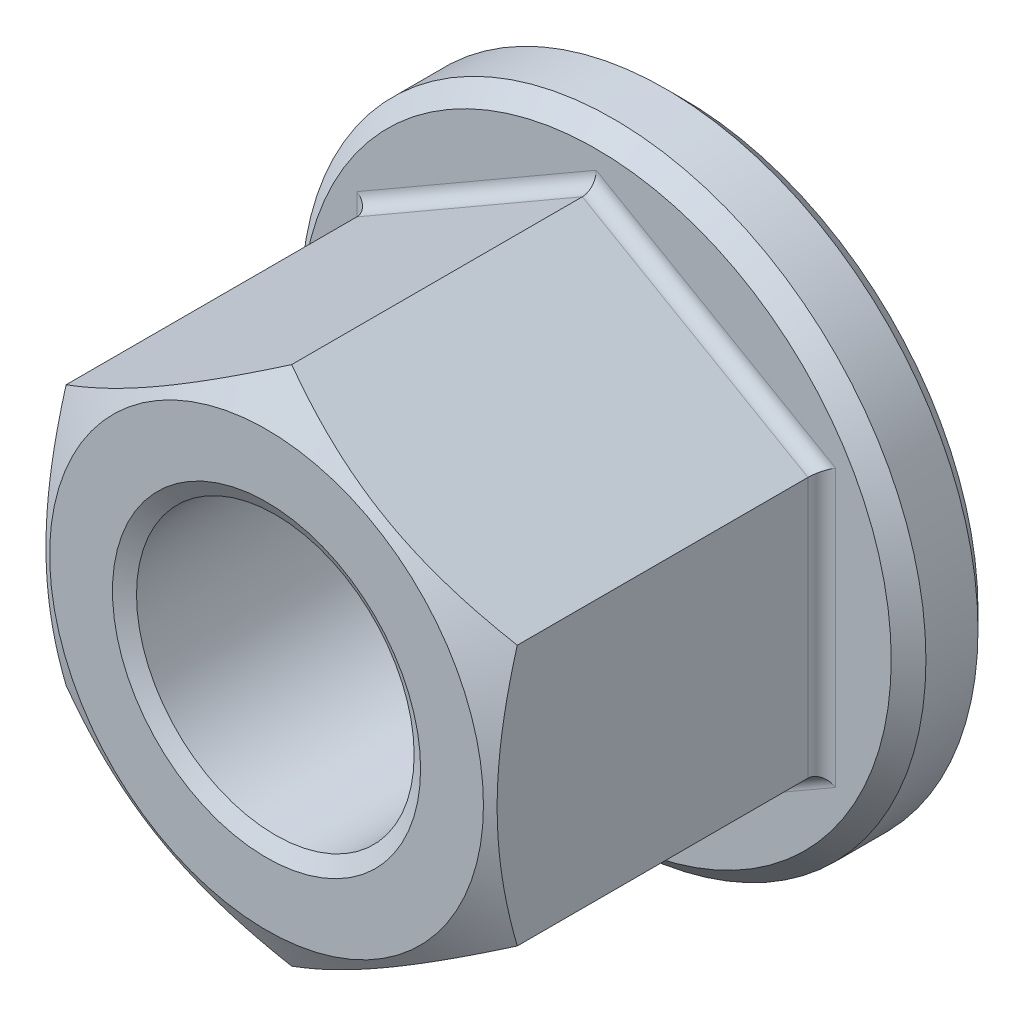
ISO-10303-21;
HEADER;
FILE_DESCRIPTION(('STEP AP214'),'2;1');
FILE_NAME('part.step','',(''),(''),'','','');
FILE_SCHEMA(('AUTOMOTIVE_DESIGN { 1 0 10303 214 1 1 1 1 }'));
ENDSEC;
DATA;
#1=APPLICATION_CONTEXT('core data for automotive mechanical design processes');
#2=APPLICATION_PROTOCOL_DEFINITION('international standard','automotive_design',2000,#1);
#3=PRODUCT_CONTEXT('',#1,'mechanical');
#4=PRODUCT('Part','Part','',(#3));
#5=PRODUCT_RELATED_PRODUCT_CATEGORY('part','',(#4));
#6=PRODUCT_DEFINITION_FORMATION('','',#4);
#7=PRODUCT_DEFINITION_CONTEXT('part definition',#1,'design');
#8=PRODUCT_DEFINITION('design','',#6,#7);
#9=PRODUCT_DEFINITION_SHAPE('','',#8);
#10=(LENGTH_UNIT() NAMED_UNIT(*) SI_UNIT(.MILLI.,.METRE.));
#11=(NAMED_UNIT(*) PLANE_ANGLE_UNIT() SI_UNIT($,.RADIAN.));
#12=(NAMED_UNIT(*) SI_UNIT($,.STERADIAN.) SOLID_ANGLE_UNIT());
#13=UNCERTAINTY_MEASURE_WITH_UNIT(LENGTH_MEASURE(1.E-05),#10,'distance_accuracy_value','');
#14=(GEOMETRIC_REPRESENTATION_CONTEXT(3) GLOBAL_UNCERTAINTY_ASSIGNED_CONTEXT((#13)) GLOBAL_UNIT_ASSIGNED_CONTEXT((#10,
#11,#12)) REPRESENTATION_CONTEXT('',''));
#15=CARTESIAN_POINT('',(0.,0.,0.));
#16=DIRECTION('',(0.,0.,1.));
#17=DIRECTION('',(1.,0.,0.));
#18=AXIS2_PLACEMENT_3D('',#15,#16,#17);
#19=CARTESIAN_POINT('',(-6.5,-3.75277674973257,2.5));
#20=DIRECTION('',(-0.5,-0.866025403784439,0.));
#21=DIRECTION('',(0.866025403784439,-0.5,0.));
#22=AXIS2_PLACEMENT_3D('',#19,#20,#21);
#23=PLANE('',#22);
#24=DIRECTION('',(0.,0.,1.));
#25=VECTOR('',#24,1.);
#26=CARTESIAN_POINT('',(-6.5,-3.75277674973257,2.5));
#27=LINE('',#26,#25);
#28=CARTESIAN_POINT('',(-6.5,-3.75277674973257,2.9));
#29=VERTEX_POINT('',#28);
#30=CARTESIAN_POINT('',(-6.5,-3.75277674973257,11.2751058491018));
#31=VERTEX_POINT('',#30);
#32=EDGE_CURVE('E166',#29,#31,#27,.T.);
#33=ORIENTED_EDGE('',*,*,#32,.F.);
#34=DIRECTION('',(0.866025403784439,-0.5,0.));
#35=VECTOR('',#34,1.);
#36=CARTESIAN_POINT('',(0.,-7.50555349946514,2.9));
#37=LINE('',#36,#35);
#38=CARTESIAN_POINT('',(0.,-7.50555349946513,2.9));
#39=VERTEX_POINT('',#38);
#40=EDGE_CURVE('E37',#29,#39,#37,.T.);
#41=ORIENTED_EDGE('',*,*,#40,.T.);
#42=DIRECTION('',(0.,0.,1.));
#43=VECTOR('',#42,1.);
#44=CARTESIAN_POINT('',(0.,-7.50555349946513,2.5));
#45=LINE('',#44,#43);
#46=CARTESIAN_POINT('',(0.,-7.50555349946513,11.2751058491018));
#47=VERTEX_POINT('',#46);
#48=EDGE_CURVE('E97',#39,#47,#45,.T.);
#49=ORIENTED_EDGE('',*,*,#48,.T.);
#50=CARTESIAN_POINT('',(0.0002,-7.50566896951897,11.2750391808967));
#51=CARTESIAN_POINT('',(-0.142677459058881,-7.4231786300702,11.3226580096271));
#52=CARTESIAN_POINT('',(-0.286087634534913,-7.34038072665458,11.3681157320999));
#53=CARTESIAN_POINT('',(-0.574072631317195,-7.17411251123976,11.4541137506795));
#54=CARTESIAN_POINT('',(-0.718647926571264,-7.09064192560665,11.4946519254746));
#55=CARTESIAN_POINT('',(-1.15468865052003,-6.83889369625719,11.6080914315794));
#56=CARTESIAN_POINT('',(-1.44787528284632,-6.66962231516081,11.6726146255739));
#57=CARTESIAN_POINT('',(-1.88662374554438,-6.41631077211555,11.7482758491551));
#58=CARTESIAN_POINT('',(-2.03087463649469,-6.33302748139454,11.7698295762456));
#59=CARTESIAN_POINT('',(-2.32002821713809,-6.16608458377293,11.8059721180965));
#60=CARTESIAN_POINT('',(-2.46493084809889,-6.08242501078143,11.8205615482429));
#61=CARTESIAN_POINT('',(-2.75498777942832,-5.91496056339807,11.8424036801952));
#62=CARTESIAN_POINT('',(-2.90014160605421,-5.8311559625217,11.8496647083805));
#63=CARTESIAN_POINT('',(-3.19057533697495,-5.66347396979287,11.8567021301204));
#64=CARTESIAN_POINT('',(-3.33585523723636,-5.5795965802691,11.8564787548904));
#65=CARTESIAN_POINT('',(-3.73387594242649,-5.34979921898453,11.8455789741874));
#66=CARTESIAN_POINT('',(-3.98648646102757,-5.20395446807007,11.8272806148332));
#67=CARTESIAN_POINT('',(-4.49002967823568,-4.91323365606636,11.7692560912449));
#68=CARTESIAN_POINT('',(-4.74096060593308,-4.76835861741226,11.7295100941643));
#69=CARTESIAN_POINT('',(-5.24551722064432,-4.47705272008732,11.6301565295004));
#70=CARTESIAN_POINT('',(-5.49907924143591,-4.33065861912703,11.5701280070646));
#71=CARTESIAN_POINT('',(-6.00242193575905,-4.04005357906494,11.4338874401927));
#72=CARTESIAN_POINT('',(-6.25220905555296,-3.89583891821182,11.357707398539));
#73=CARTESIAN_POINT('',(-6.5002,-3.75266127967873,11.2750391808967));
#74=B_SPLINE_CURVE_WITH_KNOTS('',3,(#50,#51,#52,#53,#54,#55,#56,#57,#58,#59,#60,#61,#62,#63,#64,
#65,#66,#67,#68,#69,#70,#71,#72,#73),.UNSPECIFIED.,.F.,.F.,(4,2,2,2,2,2,2,2,2,2,2,4),(0.,
0.515105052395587,1.03043143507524,2.06322554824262,2.56697389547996,3.07067772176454,
3.57380860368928,4.0769239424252,4.9527935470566,5.82947446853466,6.72559912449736,
7.61996451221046),.UNSPECIFIED.);
#75=EDGE_CURVE('E109',#47,#31,#74,.T.);
#76=ORIENTED_EDGE('',*,*,#75,.T.);
#77=EDGE_LOOP('',(#33,#41,#49,#76));
#78=FACE_BOUND('',#77,.T.);
#79=ADVANCED_FACE('F14',(#78),#23,.T.);
#80=CARTESIAN_POINT('',(-6.5,3.75277674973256,2.5));
#81=DIRECTION('',(-1.,0.,0.));
#82=DIRECTION('',(0.,-1.,0.));
#83=AXIS2_PLACEMENT_3D('',#80,#81,#82);
#84=PLANE('',#83);
#85=DIRECTION('',(0.,0.,1.));
#86=VECTOR('',#85,1.);
#87=CARTESIAN_POINT('',(-6.5,3.75277674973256,2.5));
#88=LINE('',#87,#86);
#89=CARTESIAN_POINT('',(-6.5,3.75277674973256,2.9));
#90=VERTEX_POINT('',#89);
#91=CARTESIAN_POINT('',(-6.5,3.75277674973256,11.2751058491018));
#92=VERTEX_POINT('',#91);
#93=EDGE_CURVE('E169',#90,#92,#88,.T.);
#94=ORIENTED_EDGE('',*,*,#93,.F.);
#95=DIRECTION('',(0.,-1.,0.));
#96=VECTOR('',#95,1.);
#97=CARTESIAN_POINT('',(-6.5,-3.75277674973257,2.9));
#98=LINE('',#97,#96);
#99=EDGE_CURVE('E30',#90,#29,#98,.T.);
#100=ORIENTED_EDGE('',*,*,#99,.T.);
#101=ORIENTED_EDGE('',*,*,#32,.T.);
#102=CARTESIAN_POINT('',(-6.5,-10.0756014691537,8.68582539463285));
#103=CARTESIAN_POINT('',(-6.5,-9.79164665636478,8.8235495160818));
#104=CARTESIAN_POINT('',(-6.5,-9.50703927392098,8.95995128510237));
#105=CARTESIAN_POINT('',(-6.5,-8.93617212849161,9.22936595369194));
#106=CARTESIAN_POINT('',(-6.5,-8.64991211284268,9.36237831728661));
#107=CARTESIAN_POINT('',(-6.5,-8.07391640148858,9.62493968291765));
#108=CARTESIAN_POINT('',(-6.5,-7.78417026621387,9.75446586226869));
#109=CARTESIAN_POINT('',(-6.5,-7.20237057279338,10.0082079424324));
#110=CARTESIAN_POINT('',(-6.5,-6.91031712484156,10.1324240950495));
#111=CARTESIAN_POINT('',(-6.5,-6.31423312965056,10.3779346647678));
#112=CARTESIAN_POINT('',(-6.5,-6.01011411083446,10.4990154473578));
#113=CARTESIAN_POINT('',(-6.5,-5.39831666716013,10.7320013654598));
#114=CARTESIAN_POINT('',(-6.5,-5.09063784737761,10.8439054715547));
#115=CARTESIAN_POINT('',(-6.5,-4.47180892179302,11.0555986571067));
#116=CARTESIAN_POINT('',(-6.5,-4.16066728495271,11.1554122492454));
#117=CARTESIAN_POINT('',(-6.5,-3.53391889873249,11.3397182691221));
#118=CARTESIAN_POINT('',(-6.5,-3.21831358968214,11.4242155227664));
#119=CARTESIAN_POINT('',(-6.5,-2.58412103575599,11.5734121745));
#120=CARTESIAN_POINT('',(-6.5,-2.2655579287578,11.6382125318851));
#121=CARTESIAN_POINT('',(-6.5,-1.62443244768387,11.7442965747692));
#122=CARTESIAN_POINT('',(-6.5,-1.30187048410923,11.7855826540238));
#123=CARTESIAN_POINT('',(-6.5,-0.818454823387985,11.8271350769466));
#124=CARTESIAN_POINT('',(-6.5,-0.658436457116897,11.8375863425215));
#125=CARTESIAN_POINT('',(-6.5,-0.33809408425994,11.8517188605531));
#126=CARTESIAN_POINT('',(-6.5,-0.177770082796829,11.8554002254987));
#127=CARTESIAN_POINT('',(-6.5,0.142891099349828,11.8558976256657));
#128=CARTESIAN_POINT('',(-6.5,0.303228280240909,11.8527135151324));
#129=CARTESIAN_POINT('',(-6.5,0.623626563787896,11.8395594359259));
#130=CARTESIAN_POINT('',(-6.5,0.783687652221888,11.8295891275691));
#131=CARTESIAN_POINT('',(-6.5,1.16834782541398,11.7976839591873));
#132=CARTESIAN_POINT('',(-6.5,1.39268547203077,11.7725302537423));
#133=CARTESIAN_POINT('',(-6.5,1.83968347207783,11.7102631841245));
#134=CARTESIAN_POINT('',(-6.5,2.0623435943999,11.6731482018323));
#135=CARTESIAN_POINT('',(-6.5,2.72754525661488,11.5458308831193));
#136=CARTESIAN_POINT('',(-6.5,3.16707359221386,11.4396781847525));
#137=CARTESIAN_POINT('',(-6.5,3.82460329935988,11.2556759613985));
#138=CARTESIAN_POINT('',(-6.5,4.04601181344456,11.1893039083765));
#139=CARTESIAN_POINT('',(-6.5,4.48667640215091,11.0496985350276));
#140=CARTESIAN_POINT('',(-6.5,4.70593246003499,10.9764651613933));
#141=CARTESIAN_POINT('',(-6.5,5.14236696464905,10.8243099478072));
#142=CARTESIAN_POINT('',(-6.5,5.359546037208,10.745389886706));
#143=CARTESIAN_POINT('',(-6.5,5.79210189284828,10.582786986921));
#144=CARTESIAN_POINT('',(-6.5,6.00747872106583,10.4991042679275));
#145=CARTESIAN_POINT('',(-6.5,6.60786614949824,10.2594217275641));
#146=CARTESIAN_POINT('',(-6.5,6.99110859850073,10.0989963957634));
#147=CARTESIAN_POINT('',(-6.5,7.75355950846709,9.76879628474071));
#148=CARTESIAN_POINT('',(-6.5,8.13276748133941,9.59902038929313));
#149=CARTESIAN_POINT('',(-6.5,8.88813120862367,9.25243586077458));
#150=CARTESIAN_POINT('',(-6.5,9.26428566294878,9.07562440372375));
#151=CARTESIAN_POINT('',(-6.5,10.0140399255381,8.71672619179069));
#152=CARTESIAN_POINT('',(-6.5,10.3876398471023,8.53463967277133));
#153=CARTESIAN_POINT('',(-6.5,11.1334315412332,8.16608087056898));
#154=CARTESIAN_POINT('',(-6.5,11.5056199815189,7.97960185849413));
#155=CARTESIAN_POINT('',(-6.5,12.248368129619,7.60342486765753));
#156=CARTESIAN_POINT('',(-6.5,12.6189278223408,7.41372685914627));
#157=CARTESIAN_POINT('',(-6.5,13.3586342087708,7.03180958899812));
#158=CARTESIAN_POINT('',(-6.5,13.7277812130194,6.83959092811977));
#159=CARTESIAN_POINT('',(-6.5,14.4649861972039,6.45307537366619));
#160=CARTESIAN_POINT('',(-6.5,14.8330441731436,6.25877847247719));
#161=CARTESIAN_POINT('',(-6.5,15.8541555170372,5.71672660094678));
#162=CARTESIAN_POINT('',(-6.5,16.5062381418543,5.36714339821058));
#163=CARTESIAN_POINT('',(-6.5,17.8083666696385,4.66411009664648));
#164=CARTESIAN_POINT('',(-6.5,18.4584124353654,4.31065974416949));
#165=CARTESIAN_POINT('',(-6.5,19.7547720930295,3.60208828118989));
#166=CARTESIAN_POINT('',(-6.5,20.4010911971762,3.24697669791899));
#167=CARTESIAN_POINT('',(-6.5,21.6924610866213,2.53457751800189));
#168=CARTESIAN_POINT('',(-6.5,22.3375119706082,2.17729010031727));
#169=CARTESIAN_POINT('',(-6.5,22.9821231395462,1.81921653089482));
#170=B_SPLINE_CURVE_WITH_KNOTS('',3,(#102,#103,#104,#105,#106,#107,#108,#109,#110,#111,#112,
#113,#114,#115,#116,#117,#118,#119,#120,#121,#122,#123,#124,#125,#126,#127,#128,#129,#130,#131,
#132,#133,#134,#135,#136,#137,#138,#139,#140,#141,#142,#143,#144,#145,#146,#147,#148,#149,#150,
#151,#152,#153,#154,#155,#156,#157,#158,#159,#160,#161,#162,#163,#164,#165,#166,#167,#168,#169),
.UNSPECIFIED.,.F.,.F.,(4,2,2,2,2,2,2,2,2,2,2,2,2,2,2,2,2,2,2,2,2,2,2,2,2,2,2,2,2,2,2,2,2,4),(0.,
0.94678741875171,1.89372363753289,2.84581999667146,3.79787115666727,4.7797651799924,
5.76176919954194,6.74174771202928,7.72141691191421,8.69597654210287,9.67043694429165,
10.1513934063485,10.632341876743,11.1133005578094,11.5942833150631,12.2711316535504,
12.9480715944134,14.3026549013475,14.9960254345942,15.6894013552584,16.3825613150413,
17.0757038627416,18.321906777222,19.5682587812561,20.8151162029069,22.0619179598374,
23.3107730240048,24.5596396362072,25.8082138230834,27.0567925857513,29.2764076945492,
31.4961692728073,33.7085146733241,35.9206805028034),.UNSPECIFIED.);
#171=EDGE_CURVE('E161',#31,#92,#170,.T.);
#172=ORIENTED_EDGE('',*,*,#171,.T.);
#173=EDGE_LOOP('',(#94,#100,#101,#172));
#174=FACE_BOUND('',#173,.T.);
#175=ADVANCED_FACE('F151',(#174),#84,.T.);
#176=CARTESIAN_POINT('',(0.,7.50555349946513,2.5));
#177=DIRECTION('',(-0.5,0.866025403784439,0.));
#178=DIRECTION('',(-0.866025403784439,-0.5,0.));
#179=AXIS2_PLACEMENT_3D('',#176,#177,#178);
#180=PLANE('',#179);
#181=DIRECTION('',(0.,0.,1.));
#182=VECTOR('',#181,1.);
#183=CARTESIAN_POINT('',(0.,7.50555349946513,2.5));
#184=LINE('',#183,#182);
#185=CARTESIAN_POINT('',(0.,7.50555349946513,2.9));
#186=VERTEX_POINT('',#185);
#187=CARTESIAN_POINT('',(0.,7.50555349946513,11.2751058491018));
#188=VERTEX_POINT('',#187);
#189=EDGE_CURVE('E171',#186,#188,#184,.T.);
#190=ORIENTED_EDGE('',*,*,#189,.F.);
#191=DIRECTION('',(-0.866025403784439,-0.5,0.));
#192=VECTOR('',#191,1.);
#193=CARTESIAN_POINT('',(-6.5,3.75277674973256,2.9));
#194=LINE('',#193,#192);
#195=EDGE_CURVE('E186',#186,#90,#194,.T.);
#196=ORIENTED_EDGE('',*,*,#195,.T.);
#197=ORIENTED_EDGE('',*,*,#93,.T.);
#198=CARTESIAN_POINT('',(-6.5002,3.75266127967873,11.2750391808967));
#199=CARTESIAN_POINT('',(-6.35732254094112,3.8351516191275,11.3226580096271));
#200=CARTESIAN_POINT('',(-6.21391236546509,3.91794952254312,11.3681157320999));
#201=CARTESIAN_POINT('',(-5.92592736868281,4.08421773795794,11.4541137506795));
#202=CARTESIAN_POINT('',(-5.78135207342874,4.16768832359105,11.4946519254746));
#203=CARTESIAN_POINT('',(-5.34531134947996,4.41943655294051,11.6080914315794));
#204=CARTESIAN_POINT('',(-5.05212471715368,4.58870793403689,11.6726146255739));
#205=CARTESIAN_POINT('',(-4.61337625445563,4.84201947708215,11.7482758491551));
#206=CARTESIAN_POINT('',(-4.46912536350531,4.92530276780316,11.7698295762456));
#207=CARTESIAN_POINT('',(-4.17997178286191,5.09224566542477,11.8059721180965));
#208=CARTESIAN_POINT('',(-4.03506915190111,5.17590523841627,11.8205615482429));
#209=CARTESIAN_POINT('',(-3.74501222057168,5.34336968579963,11.8424036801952));
#210=CARTESIAN_POINT('',(-3.59985839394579,5.427174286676,11.8496647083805));
#211=CARTESIAN_POINT('',(-3.30942466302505,5.59485627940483,11.8567021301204));
#212=CARTESIAN_POINT('',(-3.16414476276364,5.6787336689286,11.8564787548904));
#213=CARTESIAN_POINT('',(-2.76612405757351,5.90853103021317,11.8455789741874));
#214=CARTESIAN_POINT('',(-2.51351353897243,6.05437578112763,11.8272806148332));
#215=CARTESIAN_POINT('',(-2.00997032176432,6.34509659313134,11.7692560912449));
#216=CARTESIAN_POINT('',(-1.75903939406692,6.48997163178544,11.7295100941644));
#217=CARTESIAN_POINT('',(-1.25448277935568,6.78127752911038,11.6301565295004));
#218=CARTESIAN_POINT('',(-1.00092075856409,6.92767163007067,11.5701280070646));
#219=CARTESIAN_POINT('',(-0.497578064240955,7.21827667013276,11.4338874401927));
#220=CARTESIAN_POINT('',(-0.247790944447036,7.36249133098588,11.357707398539));
#221=CARTESIAN_POINT('',(0.000199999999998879,7.50566896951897,11.2750391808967));
#222=B_SPLINE_CURVE_WITH_KNOTS('',3,(#198,#199,#200,#201,#202,#203,#204,#205,#206,#207,#208,
#209,#210,#211,#212,#213,#214,#215,#216,#217,#218,#219,#220,#221),.UNSPECIFIED.,.F.,.F.,(4,2,2,
2,2,2,2,2,2,2,2,4),(0.,0.515105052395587,1.03043143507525,2.06322554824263,2.56697389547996,
3.07067772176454,3.57380860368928,4.0769239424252,4.9527935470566,5.82947446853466,
6.72559912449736,7.61996451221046),.UNSPECIFIED.);
#223=EDGE_CURVE('E116',#92,#188,#222,.T.);
#224=ORIENTED_EDGE('',*,*,#223,.T.);
#225=EDGE_LOOP('',(#190,#196,#197,#224));
#226=FACE_BOUND('',#225,.T.);
#227=ADVANCED_FACE('F304',(#226),#180,.T.);
#228=CARTESIAN_POINT('',(6.5,3.75277674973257,2.5));
#229=DIRECTION('',(0.5,0.866025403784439,0.));
#230=DIRECTION('',(-0.866025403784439,0.5,0.));
#231=AXIS2_PLACEMENT_3D('',#228,#229,#230);
#232=PLANE('',#231);
#233=DIRECTION('',(0.,0.,1.));
#234=VECTOR('',#233,1.);
#235=CARTESIAN_POINT('',(6.5,3.75277674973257,2.5));
#236=LINE('',#235,#234);
#237=CARTESIAN_POINT('',(6.5,3.75277674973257,2.9));
#238=VERTEX_POINT('',#237);
#239=CARTESIAN_POINT('',(6.5,3.75277674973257,11.2751058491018));
#240=VERTEX_POINT('',#239);
#241=EDGE_CURVE('E96',#238,#240,#236,.T.);
#242=ORIENTED_EDGE('',*,*,#241,.F.);
#243=DIRECTION('',(-0.866025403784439,0.5,0.));
#244=VECTOR('',#243,1.);
#245=CARTESIAN_POINT('',(0.,7.50555349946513,2.9));
#246=LINE('',#245,#244);
#247=EDGE_CURVE('E202',#238,#186,#246,.T.);
#248=ORIENTED_EDGE('',*,*,#247,.T.);
#249=ORIENTED_EDGE('',*,*,#189,.T.);
#250=CARTESIAN_POINT('',(-0.000200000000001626,7.50566896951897,11.2750391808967));
#251=CARTESIAN_POINT('',(0.142677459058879,7.4231786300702,11.3226580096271));
#252=CARTESIAN_POINT('',(0.286087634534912,7.34038072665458,11.3681157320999));
#253=CARTESIAN_POINT('',(0.574072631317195,7.17411251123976,11.4541137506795));
#254=CARTESIAN_POINT('',(0.718647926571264,7.09064192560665,11.4946519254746));
#255=CARTESIAN_POINT('',(1.15468865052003,6.83889369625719,11.6080914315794));
#256=CARTESIAN_POINT('',(1.44787528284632,6.66962231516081,11.6726146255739));
#257=CARTESIAN_POINT('',(1.88662374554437,6.41631077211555,11.7482758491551));
#258=CARTESIAN_POINT('',(2.03087463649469,6.33302748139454,11.7698295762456));
#259=CARTESIAN_POINT('',(2.32002821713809,6.16608458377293,11.8059721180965));
#260=CARTESIAN_POINT('',(2.46493084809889,6.08242501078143,11.8205615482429));
#261=CARTESIAN_POINT('',(2.75498777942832,5.91496056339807,11.8424036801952));
#262=CARTESIAN_POINT('',(2.90014160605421,5.8311559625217,11.8496647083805));
#263=CARTESIAN_POINT('',(3.19057533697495,5.66347396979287,11.8567021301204));
#264=CARTESIAN_POINT('',(3.33585523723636,5.5795965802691,11.8564787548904));
#265=CARTESIAN_POINT('',(3.73387594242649,5.34979921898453,11.8455789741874));
#266=CARTESIAN_POINT('',(3.98648646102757,5.20395446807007,11.8272806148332));
#267=CARTESIAN_POINT('',(4.49002967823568,4.91323365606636,11.7692560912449));
#268=CARTESIAN_POINT('',(4.74096060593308,4.76835861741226,11.7295100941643));
#269=CARTESIAN_POINT('',(5.24551722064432,4.47705272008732,11.6301565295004));
#270=CARTESIAN_POINT('',(5.49907924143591,4.33065861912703,11.5701280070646));
#271=CARTESIAN_POINT('',(6.00242193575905,4.04005357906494,11.4338874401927));
#272=CARTESIAN_POINT('',(6.25220905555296,3.89583891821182,11.357707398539));
#273=CARTESIAN_POINT('',(6.5002,3.75266127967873,11.2750391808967));
#274=B_SPLINE_CURVE_WITH_KNOTS('',3,(#250,#251,#252,#253,#254,#255,#256,#257,#258,#259,#260,
#261,#262,#263,#264,#265,#266,#267,#268,#269,#270,#271,#272,#273),.UNSPECIFIED.,.F.,.F.,(4,2,2,
2,2,2,2,2,2,2,2,4),(0.,0.515105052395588,1.03043143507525,2.06322554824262,2.56697389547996,
3.07067772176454,3.57380860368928,4.0769239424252,4.9527935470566,5.82947446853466,
6.72559912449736,7.61996451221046),.UNSPECIFIED.);
#275=EDGE_CURVE('E114',#188,#240,#274,.T.);
#276=ORIENTED_EDGE('',*,*,#275,.T.);
#277=EDGE_LOOP('',(#242,#248,#249,#276));
#278=FACE_BOUND('',#277,.T.);
#279=ADVANCED_FACE('F141',(#278),#232,.T.);
#280=CARTESIAN_POINT('',(6.5,-3.75277674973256,2.5));
#281=DIRECTION('',(1.,0.,0.));
#282=DIRECTION('',(0.,1.,0.));
#283=AXIS2_PLACEMENT_3D('',#280,#281,#282);
#284=PLANE('',#283);
#285=DIRECTION('',(0.,0.,1.));
#286=VECTOR('',#285,1.);
#287=CARTESIAN_POINT('',(6.5,-3.75277674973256,2.5));
#288=LINE('',#287,#286);
#289=CARTESIAN_POINT('',(6.5,-3.75277674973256,2.9));
#290=VERTEX_POINT('',#289);
#291=CARTESIAN_POINT('',(6.5,-3.75277674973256,11.2751058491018));
#292=VERTEX_POINT('',#291);
#293=EDGE_CURVE('E87',#290,#292,#288,.T.);
#294=ORIENTED_EDGE('',*,*,#293,.F.);
#295=DIRECTION('',(0.,1.,0.));
#296=VECTOR('',#295,1.);
#297=CARTESIAN_POINT('',(6.5,3.75277674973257,2.9));
#298=LINE('',#297,#296);
#299=EDGE_CURVE('E204',#290,#238,#298,.T.);
#300=ORIENTED_EDGE('',*,*,#299,.T.);
#301=ORIENTED_EDGE('',*,*,#241,.T.);
#302=CARTESIAN_POINT('',(6.5,-10.0756014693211,8.68582539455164));
#303=CARTESIAN_POINT('',(6.5,-9.79164665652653,8.82354951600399));
#304=CARTESIAN_POINT('',(6.5,-9.5070392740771,8.95995128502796));
#305=CARTESIAN_POINT('',(6.5,-8.93617212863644,9.22936595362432));
#306=CARTESIAN_POINT('',(6.5,-8.64991211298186,9.36237831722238));
#307=CARTESIAN_POINT('',(6.5,-8.07391640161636,9.62493968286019));
#308=CARTESIAN_POINT('',(6.5,-7.7841702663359,9.75446586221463));
#309=CARTESIAN_POINT('',(6.5,-7.20237057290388,10.0082079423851));
#310=CARTESIAN_POINT('',(6.5,-6.91031712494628,10.1324240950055));
#311=CARTESIAN_POINT('',(6.5,-6.3142331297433,10.3779346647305));
#312=CARTESIAN_POINT('',(6.5,-6.01011411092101,10.4990154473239));
#313=CARTESIAN_POINT('',(6.5,-5.39831666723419,10.7320013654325));
#314=CARTESIAN_POINT('',(6.5,-5.09063784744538,10.8439054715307));
#315=CARTESIAN_POINT('',(6.5,-4.47180892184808,11.0555986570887));
#316=CARTESIAN_POINT('',(6.5,-4.16066728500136,11.1554122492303));
#317=CARTESIAN_POINT('',(6.5,-3.53391889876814,11.3397182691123));
#318=CARTESIAN_POINT('',(6.5,-3.2183135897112,11.4242155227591));
#319=CARTESIAN_POINT('',(6.5,-2.58412103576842,11.5734121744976));
#320=CARTESIAN_POINT('',(6.5,-2.26555792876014,11.6382125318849));
#321=CARTESIAN_POINT('',(6.5,-1.6244324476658,11.744296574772));
#322=CARTESIAN_POINT('',(6.5,-1.30187048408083,11.7855826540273));
#323=CARTESIAN_POINT('',(6.5,-0.818454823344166,11.8271350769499));
#324=CARTESIAN_POINT('',(6.5,-0.658436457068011,11.8375863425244));
#325=CARTESIAN_POINT('',(6.5,-0.338094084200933,11.8517188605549));
#326=CARTESIAN_POINT('',(6.5,-0.177770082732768,11.8554002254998));
#327=CARTESIAN_POINT('',(6.5,0.142891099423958,11.8558976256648));
#328=CARTESIAN_POINT('',(6.5,0.303228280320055,11.8527135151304));
#329=CARTESIAN_POINT('',(6.5,0.623626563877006,11.839559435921));
#330=CARTESIAN_POINT('',(6.5,0.783687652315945,11.8295891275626));
#331=CARTESIAN_POINT('',(6.5,1.16834782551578,11.797683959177));
#332=CARTESIAN_POINT('',(6.5,1.39268547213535,11.7725302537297));
#333=CARTESIAN_POINT('',(6.5,1.83968347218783,11.7102631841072));
#334=CARTESIAN_POINT('',(6.5,2.06234359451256,11.6731482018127));
#335=CARTESIAN_POINT('',(6.5,2.72754525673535,11.5458308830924));
#336=CARTESIAN_POINT('',(6.5,3.16707359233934,11.4396781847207));
#337=CARTESIAN_POINT('',(6.5,3.82460329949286,11.2556759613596));
#338=CARTESIAN_POINT('',(6.5,4.0460118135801,11.1893039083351));
#339=CARTESIAN_POINT('',(6.5,4.48667640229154,11.0496985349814));
#340=CARTESIAN_POINT('',(6.5,4.70593246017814,10.9764651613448));
#341=CARTESIAN_POINT('',(6.5,5.14236696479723,10.8243099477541));
#342=CARTESIAN_POINT('',(6.5,5.3595460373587,10.7453898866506));
#343=CARTESIAN_POINT('',(6.5,5.792101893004,10.5827869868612));
#344=CARTESIAN_POINT('',(6.5,6.00747872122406,10.4991042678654));
#345=CARTESIAN_POINT('',(6.5,6.60786614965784,10.2594217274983));
#346=CARTESIAN_POINT('',(6.5,6.99110859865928,10.0989963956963));
#347=CARTESIAN_POINT('',(6.5,7.75355950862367,9.76879628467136));
#348=CARTESIAN_POINT('',(6.5,8.13276748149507,9.59902038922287));
#349=CARTESIAN_POINT('',(6.5,8.88813120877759,9.25243586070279));
#350=CARTESIAN_POINT('',(6.5,9.26428566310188,9.07562440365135));
#351=CARTESIAN_POINT('',(6.5,10.0140399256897,8.71672619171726));
#352=CARTESIAN_POINT('',(6.5,10.3876398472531,8.53463967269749));
#353=CARTESIAN_POINT('',(6.5,11.1334315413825,8.16608087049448));
#354=CARTESIAN_POINT('',(6.5,11.5056199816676,7.97960185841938));
#355=CARTESIAN_POINT('',(6.5,12.2483681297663,7.6034248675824));
#356=CARTESIAN_POINT('',(6.5,12.6189278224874,7.413726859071));
#357=CARTESIAN_POINT('',(6.5,13.3586342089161,7.03180958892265));
#358=CARTESIAN_POINT('',(6.5,13.7277812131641,6.83959092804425));
#359=CARTESIAN_POINT('',(6.5,14.4649861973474,6.4530753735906));
#360=CARTESIAN_POINT('',(6.5,14.8330441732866,6.2587784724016));
#361=CARTESIAN_POINT('',(6.5,15.8541555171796,5.71672660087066));
#362=CARTESIAN_POINT('',(6.49999999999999,16.5062381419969,5.36714339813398));
#363=CARTESIAN_POINT('',(6.49999999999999,17.8083666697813,4.664110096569));
#364=CARTESIAN_POINT('',(6.49999999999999,18.4584124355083,4.31065974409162));
#365=CARTESIAN_POINT('',(6.49999999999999,19.754772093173,3.60208828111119));
#366=CARTESIAN_POINT('',(6.49999999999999,20.40109119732,3.24697669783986));
#367=CARTESIAN_POINT('',(6.49999999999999,21.6924610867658,2.53457751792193));
#368=CARTESIAN_POINT('',(6.5,22.3375119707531,2.17729010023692));
#369=CARTESIAN_POINT('',(6.5,22.9821231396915,1.8192165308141));
#370=B_SPLINE_CURVE_WITH_KNOTS('',3,(#302,#303,#304,#305,#306,#307,#308,#309,#310,#311,#312,
#313,#314,#315,#316,#317,#318,#319,#320,#321,#322,#323,#324,#325,#326,#327,#328,#329,#330,#331,
#332,#333,#334,#335,#336,#337,#338,#339,#340,#341,#342,#343,#344,#345,#346,#347,#348,#349,#350,
#351,#352,#353,#354,#355,#356,#357,#358,#359,#360,#361,#362,#363,#364,#365,#366,#367,#368,#369),
.UNSPECIFIED.,.F.,.F.,(4,2,2,2,2,2,2,2,2,2,2,2,2,2,2,2,2,2,2,2,2,2,2,2,2,2,2,2,2,2,2,2,2,4),(0.,
0.946787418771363,1.8937236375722,2.84581999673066,3.79787115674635,4.77976518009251,
5.76176919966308,6.74174771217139,7.72141691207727,8.69597654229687,9.67043694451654,
10.1513934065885,10.632341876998,11.1133005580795,11.5942833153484,12.2711316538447,
12.9480715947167,14.3026549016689,14.996025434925,15.6894013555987,16.382561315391,
17.0757038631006,18.3219067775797,19.5682587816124,20.8151162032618,22.0619179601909,
23.3107730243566,24.5596396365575,25.8082138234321,27.0567925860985,29.2764076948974,
31.4961692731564,33.7085146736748,35.9206805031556),.UNSPECIFIED.);
#371=EDGE_CURVE('E105',#240,#292,#370,.F.);
#372=ORIENTED_EDGE('',*,*,#371,.T.);
#373=EDGE_LOOP('',(#294,#300,#301,#372));
#374=FACE_BOUND('',#373,.T.);
#375=ADVANCED_FACE('F112',(#374),#284,.T.);
#376=CARTESIAN_POINT('',(0.,-7.50555349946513,2.5));
#377=DIRECTION('',(0.5,-0.866025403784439,0.));
#378=DIRECTION('',(0.866025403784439,0.5,0.));
#379=AXIS2_PLACEMENT_3D('',#376,#377,#378);
#380=PLANE('',#379);
#381=ORIENTED_EDGE('',*,*,#48,.F.);
#382=DIRECTION('',(0.866025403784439,0.5,0.));
#383=VECTOR('',#382,1.);
#384=CARTESIAN_POINT('',(6.5,-3.75277674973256,2.9));
#385=LINE('',#384,#383);
#386=EDGE_CURVE('E92',#39,#290,#385,.T.);
#387=ORIENTED_EDGE('',*,*,#386,.T.);
#388=ORIENTED_EDGE('',*,*,#293,.T.);
#389=CARTESIAN_POINT('',(6.5002,-3.75266127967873,11.2750391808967));
#390=CARTESIAN_POINT('',(6.35732254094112,-3.8351516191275,11.3226580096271));
#391=CARTESIAN_POINT('',(6.21391236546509,-3.91794952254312,11.3681157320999));
#392=CARTESIAN_POINT('',(5.9259273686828,-4.08421773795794,11.4541137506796));
#393=CARTESIAN_POINT('',(5.78135207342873,-4.16768832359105,11.4946519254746));
#394=CARTESIAN_POINT('',(5.34531134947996,-4.41943655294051,11.6080914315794));
#395=CARTESIAN_POINT('',(5.05212471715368,-4.58870793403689,11.6726146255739));
#396=CARTESIAN_POINT('',(4.61337625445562,-4.84201947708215,11.7482758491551));
#397=CARTESIAN_POINT('',(4.46912536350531,-4.92530276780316,11.7698295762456));
#398=CARTESIAN_POINT('',(4.17997178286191,-5.09224566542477,11.8059721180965));
#399=CARTESIAN_POINT('',(4.03506915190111,-5.17590523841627,11.8205615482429));
#400=CARTESIAN_POINT('',(3.74501222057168,-5.34336968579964,11.8424036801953));
#401=CARTESIAN_POINT('',(3.59985839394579,-5.427174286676,11.8496647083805));
#402=CARTESIAN_POINT('',(3.30942466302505,-5.59485627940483,11.8567021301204));
#403=CARTESIAN_POINT('',(3.16414476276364,-5.6787336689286,11.8564787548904));
#404=CARTESIAN_POINT('',(2.7661240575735,-5.90853103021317,11.8455789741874));
#405=CARTESIAN_POINT('',(2.51351353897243,-6.05437578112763,11.8272806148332));
#406=CARTESIAN_POINT('',(2.00997032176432,-6.34509659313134,11.7692560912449));
#407=CARTESIAN_POINT('',(1.75903939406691,-6.48997163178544,11.7295100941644));
#408=CARTESIAN_POINT('',(1.25448277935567,-6.78127752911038,11.6301565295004));
#409=CARTESIAN_POINT('',(1.00092075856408,-6.92767163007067,11.5701280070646));
#410=CARTESIAN_POINT('',(0.497578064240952,-7.21827667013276,11.4338874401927));
#411=CARTESIAN_POINT('',(0.247790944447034,-7.36249133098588,11.357707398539));
#412=CARTESIAN_POINT('',(-0.000200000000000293,-7.50566896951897,11.2750391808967));
#413=B_SPLINE_CURVE_WITH_KNOTS('',3,(#389,#390,#391,#392,#393,#394,#395,#396,#397,#398,#399,
#400,#401,#402,#403,#404,#405,#406,#407,#408,#409,#410,#411,#412),.UNSPECIFIED.,.F.,.F.,(4,2,2,
2,2,2,2,2,2,2,2,4),(0.,0.515105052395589,1.03043143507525,2.06322554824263,2.56697389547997,
3.07067772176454,3.57380860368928,4.07692394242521,4.9527935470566,5.82947446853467,
6.72559912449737,7.61996451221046),.UNSPECIFIED.);
#414=EDGE_CURVE('E90',#292,#47,#413,.T.);
#415=ORIENTED_EDGE('',*,*,#414,.T.);
#416=EDGE_LOOP('',(#381,#387,#388,#415));
#417=FACE_BOUND('',#416,.T.);
#418=ADVANCED_FACE('F89',(#417),#380,.T.);
#419=CARTESIAN_POINT('',(0.,0.,12.));
#420=DIRECTION('',(0.,0.,-1.));
#421=DIRECTION('',(-1.,0.,0.));
#422=AXIS2_PLACEMENT_3D('',#419,#420,#421);
#423=CYLINDRICAL_SURFACE('',#422,9.);
#424=CARTESIAN_POINT('',(0.,0.,0.5));
#425=DIRECTION('',(0.,0.,1.));
#426=DIRECTION('',(1.,0.,0.));
#427=AXIS2_PLACEMENT_3D('',#424,#425,#426);
#428=CIRCLE('',#427,9.);
#429=CARTESIAN_POINT('',(9.,0.,0.5));
#430=VERTEX_POINT('',#429);
#431=EDGE_CURVE('E177',#430,#430,#428,.T.);
#432=ORIENTED_EDGE('',*,*,#431,.T.);
#433=EDGE_LOOP('',(#432));
#434=FACE_BOUND('',#433,.T.);
#435=CARTESIAN_POINT('',(0.,0.,2.));
#436=DIRECTION('',(0.,0.,1.));
#437=DIRECTION('',(1.,0.,0.));
#438=AXIS2_PLACEMENT_3D('',#435,#436,#437);
#439=CIRCLE('',#438,9.);
#440=CARTESIAN_POINT('',(9.,0.,2.));
#441=VERTEX_POINT('',#440);
#442=EDGE_CURVE('E168',#441,#441,#439,.F.);
#443=ORIENTED_EDGE('',*,*,#442,.T.);
#444=EDGE_LOOP('',(#443));
#445=FACE_BOUND('',#444,.T.);
#446=ADVANCED_FACE('F147',(#434,#445),#423,.T.);
#447=CARTESIAN_POINT('',(0.,0.,0.));
#448=DIRECTION('',(0.,0.,1.));
#449=DIRECTION('',(1.,0.,0.));
#450=AXIS2_PLACEMENT_3D('',#447,#448,#449);
#451=PLANE('',#450);
#452=CARTESIAN_POINT('',(0.,0.,0.));
#453=DIRECTION('',(0.,0.,1.));
#454=DIRECTION('',(1.,0.,0.));
#455=AXIS2_PLACEMENT_3D('',#452,#453,#454);
#456=CIRCLE('',#455,4.43923048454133);
#457=CARTESIAN_POINT('',(4.43923048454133,0.,0.));
#458=VERTEX_POINT('',#457);
#459=EDGE_CURVE('E9',#458,#458,#456,.T.);
#460=ORIENTED_EDGE('',*,*,#459,.T.);
#461=EDGE_LOOP('',(#460));
#462=FACE_BOUND('',#461,.T.);
#463=CARTESIAN_POINT('',(0.,0.,0.));
#464=DIRECTION('',(0.,0.,1.));
#465=DIRECTION('',(1.,0.,0.));
#466=AXIS2_PLACEMENT_3D('',#463,#464,#465);
#467=CIRCLE('',#466,8.5);
#468=CARTESIAN_POINT('',(8.5,0.,0.));
#469=VERTEX_POINT('',#468);
#470=EDGE_CURVE('E180',#469,#469,#467,.F.);
#471=ORIENTED_EDGE('',*,*,#470,.T.);
#472=EDGE_LOOP('',(#471));
#473=FACE_BOUND('',#472,.T.);
#474=ADVANCED_FACE('F277',(#462,#473),#451,.F.);
#475=CARTESIAN_POINT('',(0.,0.,2.5));
#476=DIRECTION('',(0.,0.,1.));
#477=DIRECTION('',(1.,0.,0.));
#478=AXIS2_PLACEMENT_3D('',#475,#476,#477);
#479=PLANE('',#478);
#480=DIRECTION('',(0.,-1.,0.));
#481=VECTOR('',#480,1.);
#482=CARTESIAN_POINT('',(-6.9,3.75277674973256,2.5));
#483=LINE('',#482,#481);
#484=CARTESIAN_POINT('',(-6.9,-3.98371685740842,2.5));
#485=VERTEX_POINT('',#484);
#486=CARTESIAN_POINT('',(-6.9,3.98371685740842,2.5));
#487=VERTEX_POINT('',#486);
#488=EDGE_CURVE('E189',#485,#487,#483,.F.);
#489=ORIENTED_EDGE('',*,*,#488,.T.);
#490=DIRECTION('',(-0.866025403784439,-0.5,0.));
#491=VECTOR('',#490,1.);
#492=CARTESIAN_POINT('',(-0.2,7.85196366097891,2.5));
#493=LINE('',#492,#491);
#494=CARTESIAN_POINT('',(0.,7.96743371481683,2.5));
#495=VERTEX_POINT('',#494);
#496=EDGE_CURVE('E199',#487,#495,#493,.F.);
#497=ORIENTED_EDGE('',*,*,#496,.T.);
#498=DIRECTION('',(-0.866025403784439,0.5,0.));
#499=VECTOR('',#498,1.);
#500=CARTESIAN_POINT('',(6.7,4.09918691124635,2.5));
#501=LINE('',#500,#499);
#502=CARTESIAN_POINT('',(6.9,3.98371685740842,2.5));
#503=VERTEX_POINT('',#502);
#504=EDGE_CURVE('E197',#495,#503,#501,.F.);
#505=ORIENTED_EDGE('',*,*,#504,.T.);
#506=DIRECTION('',(0.,1.,0.));
#507=VECTOR('',#506,1.);
#508=CARTESIAN_POINT('',(6.9,-3.75277674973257,2.5));
#509=LINE('',#508,#507);
#510=CARTESIAN_POINT('',(6.9,-3.98371685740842,2.5));
#511=VERTEX_POINT('',#510);
#512=EDGE_CURVE('E195',#503,#511,#509,.F.);
#513=ORIENTED_EDGE('',*,*,#512,.T.);
#514=DIRECTION('',(0.866025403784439,0.5,0.));
#515=VECTOR('',#514,1.);
#516=CARTESIAN_POINT('',(0.2,-7.85196366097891,2.5));
#517=LINE('',#516,#515);
#518=CARTESIAN_POINT('',(0.,-7.96743371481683,2.5));
#519=VERTEX_POINT('',#518);
#520=EDGE_CURVE('E193',#511,#519,#517,.F.);
#521=ORIENTED_EDGE('',*,*,#520,.T.);
#522=DIRECTION('',(0.866025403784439,-0.5,0.));
#523=VECTOR('',#522,1.);
#524=CARTESIAN_POINT('',(-6.7,-4.09918691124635,2.5));
#525=LINE('',#524,#523);
#526=EDGE_CURVE('E191',#519,#485,#525,.F.);
#527=ORIENTED_EDGE('',*,*,#526,.T.);
#528=EDGE_LOOP('',(#489,#497,#505,#513,#521,#527));
#529=FACE_BOUND('',#528,.T.);
#530=CARTESIAN_POINT('',(0.,0.,2.5));
#531=DIRECTION('',(0.,0.,1.));
#532=DIRECTION('',(1.,0.,0.));
#533=AXIS2_PLACEMENT_3D('',#530,#531,#532);
#534=CIRCLE('',#533,8.5);
#535=CARTESIAN_POINT('',(8.5,0.,2.5));
#536=VERTEX_POINT('',#535);
#537=EDGE_CURVE('E183',#536,#536,#534,.T.);
#538=ORIENTED_EDGE('',*,*,#537,.T.);
#539=EDGE_LOOP('',(#538));
#540=FACE_BOUND('',#539,.T.);
#541=ADVANCED_FACE('F152',(#529,#540),#479,.T.);
#542=CARTESIAN_POINT('',(0.,0.,12.));
#543=DIRECTION('',(0.,0.,-1.));
#544=DIRECTION('',(1.,0.,0.));
#545=AXIS2_PLACEMENT_3D('',#542,#543,#544);
#546=CONICAL_SURFACE('',#545,6.25,1.0471975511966);
#547=ORIENTED_EDGE('',*,*,#414,.F.);
#548=ORIENTED_EDGE('',*,*,#371,.F.);
#549=ORIENTED_EDGE('',*,*,#275,.F.);
#550=ORIENTED_EDGE('',*,*,#223,.F.);
#551=ORIENTED_EDGE('',*,*,#171,.F.);
#552=ORIENTED_EDGE('',*,*,#75,.F.);
#553=EDGE_LOOP('',(#547,#548,#549,#550,#551,#552));
#554=FACE_BOUND('',#553,.T.);
#555=CARTESIAN_POINT('',(0.,0.,12.));
#556=DIRECTION('',(0.,0.,1.));
#557=DIRECTION('',(1.,0.,0.));
#558=AXIS2_PLACEMENT_3D('',#555,#556,#557);
#559=CIRCLE('',#558,6.25);
#560=CARTESIAN_POINT('',(6.25,0.,12.));
#561=VERTEX_POINT('',#560);
#562=EDGE_CURVE('E110',#561,#561,#559,.T.);
#563=ORIENTED_EDGE('',*,*,#562,.F.);
#564=EDGE_LOOP('',(#563));
#565=FACE_BOUND('',#564,.T.);
#566=ADVANCED_FACE('F102',(#554,#565),#546,.T.);
#567=CARTESIAN_POINT('',(0.,0.,12.));
#568=DIRECTION('',(0.,0.,1.));
#569=DIRECTION('',(1.,0.,0.));
#570=AXIS2_PLACEMENT_3D('',#567,#568,#569);
#571=PLANE('',#570);
#572=CARTESIAN_POINT('',(0.,0.,12.));
#573=DIRECTION('',(0.,0.,1.));
#574=DIRECTION('',(1.,0.,0.));
#575=AXIS2_PLACEMENT_3D('',#572,#573,#574);
#576=CIRCLE('',#575,4.43923048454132);
#577=CARTESIAN_POINT('',(4.43923048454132,0.,12.));
#578=VERTEX_POINT('',#577);
#579=EDGE_CURVE('E23',#578,#578,#576,.F.);
#580=ORIENTED_EDGE('',*,*,#579,.T.);
#581=EDGE_LOOP('',(#580));
#582=FACE_BOUND('',#581,.T.);
#583=ORIENTED_EDGE('',*,*,#562,.T.);
#584=EDGE_LOOP('',(#583));
#585=FACE_BOUND('',#584,.T.);
#586=ADVANCED_FACE('F229',(#582,#585),#571,.T.);
#587=CARTESIAN_POINT('',(0.,0.,0.5));
#588=DIRECTION('',(0.,0.,1.));
#589=DIRECTION('',(1.,0.,0.));
#590=AXIS2_PLACEMENT_3D('',#587,#588,#589);
#591=CONICAL_SURFACE('',#590,9.,0.78539816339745);
#592=ORIENTED_EDGE('',*,*,#470,.F.);
#593=EDGE_LOOP('',(#592));
#594=FACE_BOUND('',#593,.T.);
#595=ORIENTED_EDGE('',*,*,#431,.F.);
#596=EDGE_LOOP('',(#595));
#597=FACE_BOUND('',#596,.T.);
#598=ADVANCED_FACE('F270',(#594,#597),#591,.T.);
#599=CARTESIAN_POINT('',(0.,0.,2.5));
#600=DIRECTION('',(0.,0.,-1.));
#601=DIRECTION('',(-1.,0.,0.));
#602=AXIS2_PLACEMENT_3D('',#599,#600,#601);
#603=CONICAL_SURFACE('',#602,8.5,0.785398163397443);
#604=ORIENTED_EDGE('',*,*,#442,.F.);
#605=EDGE_LOOP('',(#604));
#606=FACE_BOUND('',#605,.T.);
#607=ORIENTED_EDGE('',*,*,#537,.F.);
#608=EDGE_LOOP('',(#607));
#609=FACE_BOUND('',#608,.T.);
#610=ADVANCED_FACE('F252',(#606,#609),#603,.T.);
#611=CARTESIAN_POINT('',(0.2,-7.85196366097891,2.9));
#612=DIRECTION('',(-0.866025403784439,-0.5,0.));
#613=DIRECTION('',(0.5,-0.866025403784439,0.));
#614=AXIS2_PLACEMENT_3D('',#611,#612,#613);
#615=CYLINDRICAL_SURFACE('',#614,0.4);
#616=CARTESIAN_POINT('',(0.,-7.96743371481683,2.9));
#617=DIRECTION('',(-1.,0.,0.));
#618=DIRECTION('',(0.,1.,0.));
#619=AXIS2_PLACEMENT_3D('',#616,#617,#618);
#620=ELLIPSE('',#619,0.461880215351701,0.4);
#621=EDGE_CURVE('E220',#519,#39,#620,.F.);
#622=ORIENTED_EDGE('',*,*,#621,.F.);
#623=ORIENTED_EDGE('',*,*,#520,.F.);
#624=CARTESIAN_POINT('',(6.9,-3.98371685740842,2.9));
#625=DIRECTION('',(-0.5,-0.866025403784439,0.));
#626=DIRECTION('',(-0.866025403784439,0.5,0.));
#627=AXIS2_PLACEMENT_3D('',#624,#625,#626);
#628=ELLIPSE('',#627,0.461880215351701,0.4);
#629=EDGE_CURVE('E223',#290,#511,#628,.T.);
#630=ORIENTED_EDGE('',*,*,#629,.F.);
#631=ORIENTED_EDGE('',*,*,#386,.F.);
#632=EDGE_LOOP('',(#622,#623,#630,#631));
#633=FACE_BOUND('',#632,.T.);
#634=ADVANCED_FACE('F248',(#633),#615,.F.);
#635=CARTESIAN_POINT('',(6.9,-3.75277674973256,2.9));
#636=DIRECTION('',(0.,-1.,0.));
#637=DIRECTION('',(1.,0.,0.));
#638=AXIS2_PLACEMENT_3D('',#635,#636,#637);
#639=CYLINDRICAL_SURFACE('',#638,0.4);
#640=ORIENTED_EDGE('',*,*,#629,.T.);
#641=ORIENTED_EDGE('',*,*,#512,.F.);
#642=CARTESIAN_POINT('',(6.9,3.98371685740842,2.9));
#643=DIRECTION('',(0.5,-0.866025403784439,0.));
#644=DIRECTION('',(-0.866025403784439,-0.5,0.));
#645=AXIS2_PLACEMENT_3D('',#642,#643,#644);
#646=ELLIPSE('',#645,0.461880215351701,0.4);
#647=EDGE_CURVE('E217',#238,#503,#646,.T.);
#648=ORIENTED_EDGE('',*,*,#647,.F.);
#649=ORIENTED_EDGE('',*,*,#299,.F.);
#650=EDGE_LOOP('',(#640,#641,#648,#649));
#651=FACE_BOUND('',#650,.T.);
#652=ADVANCED_FACE('F251',(#651),#639,.F.);
#653=CARTESIAN_POINT('',(-6.7,-4.09918691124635,2.9));
#654=DIRECTION('',(-0.866025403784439,0.5,0.));
#655=DIRECTION('',(-0.5,-0.866025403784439,0.));
#656=AXIS2_PLACEMENT_3D('',#653,#654,#655);
#657=CYLINDRICAL_SURFACE('',#656,0.4);
#658=ORIENTED_EDGE('',*,*,#621,.T.);
#659=ORIENTED_EDGE('',*,*,#40,.F.);
#660=CARTESIAN_POINT('',(-6.9,-3.98371685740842,2.9));
#661=DIRECTION('',(-0.5,0.866025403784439,0.));
#662=DIRECTION('',(0.866025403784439,0.5,0.));
#663=AXIS2_PLACEMENT_3D('',#660,#661,#662);
#664=ELLIPSE('',#663,0.461880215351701,0.4);
#665=EDGE_CURVE('E214',#485,#29,#664,.F.);
#666=ORIENTED_EDGE('',*,*,#665,.F.);
#667=ORIENTED_EDGE('',*,*,#526,.F.);
#668=EDGE_LOOP('',(#658,#659,#666,#667));
#669=FACE_BOUND('',#668,.T.);
#670=ADVANCED_FACE('F256',(#669),#657,.F.);
#671=CARTESIAN_POINT('',(6.7,4.09918691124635,2.9));
#672=DIRECTION('',(0.866025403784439,-0.5,0.));
#673=DIRECTION('',(0.5,0.866025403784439,0.));
#674=AXIS2_PLACEMENT_3D('',#671,#672,#673);
#675=CYLINDRICAL_SURFACE('',#674,0.4);
#676=ORIENTED_EDGE('',*,*,#647,.T.);
#677=ORIENTED_EDGE('',*,*,#504,.F.);
#678=CARTESIAN_POINT('',(0.,7.96743371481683,2.9));
#679=DIRECTION('',(1.,0.,0.));
#680=DIRECTION('',(0.,-1.,0.));
#681=AXIS2_PLACEMENT_3D('',#678,#679,#680);
#682=ELLIPSE('',#681,0.461880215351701,0.4);
#683=EDGE_CURVE('E211',#186,#495,#682,.T.);
#684=ORIENTED_EDGE('',*,*,#683,.F.);
#685=ORIENTED_EDGE('',*,*,#247,.F.);
#686=EDGE_LOOP('',(#676,#677,#684,#685));
#687=FACE_BOUND('',#686,.T.);
#688=ADVANCED_FACE('F260',(#687),#675,.F.);
#689=CARTESIAN_POINT('',(-6.9,3.75277674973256,2.9));
#690=DIRECTION('',(0.,1.,0.));
#691=DIRECTION('',(-1.,0.,0.));
#692=AXIS2_PLACEMENT_3D('',#689,#690,#691);
#693=CYLINDRICAL_SURFACE('',#692,0.4);
#694=ORIENTED_EDGE('',*,*,#665,.T.);
#695=ORIENTED_EDGE('',*,*,#99,.F.);
#696=CARTESIAN_POINT('',(-6.9,3.98371685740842,2.9));
#697=DIRECTION('',(0.5,0.866025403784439,0.));
#698=DIRECTION('',(-0.866025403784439,0.5,0.));
#699=AXIS2_PLACEMENT_3D('',#696,#697,#698);
#700=ELLIPSE('',#699,0.461880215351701,0.4);
#701=EDGE_CURVE('E209',#487,#90,#700,.F.);
#702=ORIENTED_EDGE('',*,*,#701,.F.);
#703=ORIENTED_EDGE('',*,*,#488,.F.);
#704=EDGE_LOOP('',(#694,#695,#702,#703));
#705=FACE_BOUND('',#704,.T.);
#706=ADVANCED_FACE('F243',(#705),#693,.F.);
#707=CARTESIAN_POINT('',(-0.2,7.85196366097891,2.9));
#708=DIRECTION('',(0.866025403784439,0.5,0.));
#709=DIRECTION('',(-0.5,0.866025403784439,0.));
#710=AXIS2_PLACEMENT_3D('',#707,#708,#709);
#711=CYLINDRICAL_SURFACE('',#710,0.4);
#712=ORIENTED_EDGE('',*,*,#683,.T.);
#713=ORIENTED_EDGE('',*,*,#496,.F.);
#714=ORIENTED_EDGE('',*,*,#701,.T.);
#715=ORIENTED_EDGE('',*,*,#195,.F.);
#716=EDGE_LOOP('',(#712,#713,#714,#715));
#717=FACE_BOUND('',#716,.T.);
#718=ADVANCED_FACE('F234',(#717),#711,.F.);
#719=CARTESIAN_POINT('',(0.,0.,11.4));
#720=DIRECTION('',(0.,0.,1.));
#721=DIRECTION('',(1.,0.,0.));
#722=AXIS2_PLACEMENT_3D('',#719,#720,#721);
#723=CONICAL_SURFACE('',#722,3.4,1.0471975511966);
#724=CARTESIAN_POINT('',(0.,0.,11.7464101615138));
#725=DIRECTION('',(0.,0.,1.));
#726=DIRECTION('',(1.,0.,0.));
#727=AXIS2_PLACEMENT_3D('',#724,#725,#726);
#728=CIRCLE('',#727,4.);
#729=CARTESIAN_POINT('',(4.,0.,11.7464101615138));
#730=VERTEX_POINT('',#729);
#731=EDGE_CURVE('E212',#730,#730,#728,.T.);
#732=ORIENTED_EDGE('',*,*,#731,.F.);
#733=EDGE_LOOP('',(#732));
#734=FACE_BOUND('',#733,.T.);
#735=ORIENTED_EDGE('',*,*,#579,.F.);
#736=EDGE_LOOP('',(#735));
#737=FACE_BOUND('',#736,.T.);
#738=ADVANCED_FACE('F232',(#734,#737),#723,.F.);
#739=CARTESIAN_POINT('',(0.,0.,0.));
#740=DIRECTION('',(0.,0.,-1.));
#741=DIRECTION('',(-1.,0.,0.));
#742=AXIS2_PLACEMENT_3D('',#739,#740,#741);
#743=CONICAL_SURFACE('',#742,4.43923048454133,1.0471975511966);
#744=CARTESIAN_POINT('',(0.,0.,0.253589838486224));
#745=DIRECTION('',(0.,0.,-1.));
#746=DIRECTION('',(-1.,0.,0.));
#747=AXIS2_PLACEMENT_3D('',#744,#745,#746);
#748=CIRCLE('',#747,4.);
#749=CARTESIAN_POINT('',(-4.,0.,0.253589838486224));
#750=VERTEX_POINT('',#749);
#751=EDGE_CURVE('E18',#750,#750,#748,.T.);
#752=ORIENTED_EDGE('',*,*,#751,.F.);
#753=EDGE_LOOP('',(#752));
#754=FACE_BOUND('',#753,.T.);
#755=ORIENTED_EDGE('',*,*,#459,.F.);
#756=EDGE_LOOP('',(#755));
#757=FACE_BOUND('',#756,.T.);
#758=ADVANCED_FACE('F16',(#754,#757),#743,.F.);
#759=CARTESIAN_POINT('',(0.,0.,0.));
#760=DIRECTION('',(0.,0.,1.));
#761=DIRECTION('',(1.,0.,0.));
#762=AXIS2_PLACEMENT_3D('',#759,#760,#761);
#763=CYLINDRICAL_SURFACE('',#762,4.);
#764=ORIENTED_EDGE('',*,*,#731,.T.);
#765=EDGE_LOOP('',(#764));
#766=FACE_BOUND('',#765,.T.);
#767=ORIENTED_EDGE('',*,*,#751,.T.);
#768=EDGE_LOOP('',(#767));
#769=FACE_BOUND('',#768,.T.);
#770=ADVANCED_FACE('F241',(#766,#769),#763,.F.);
#771=CLOSED_SHELL('',(#79,#175,#227,#279,#375,#418,#446,#474,#541,#566,#586,#598,#610,#634,#652,
#670,#688,#706,#718,#738,#758,#770));
#772=MANIFOLD_SOLID_BREP('B1',#771);
#773=ADVANCED_BREP_SHAPE_REPRESENTATION('',(#18,#772),#14);
#774=SHAPE_DEFINITION_REPRESENTATION(#9,#773);
ENDSEC;
END-ISO-10303-21;
